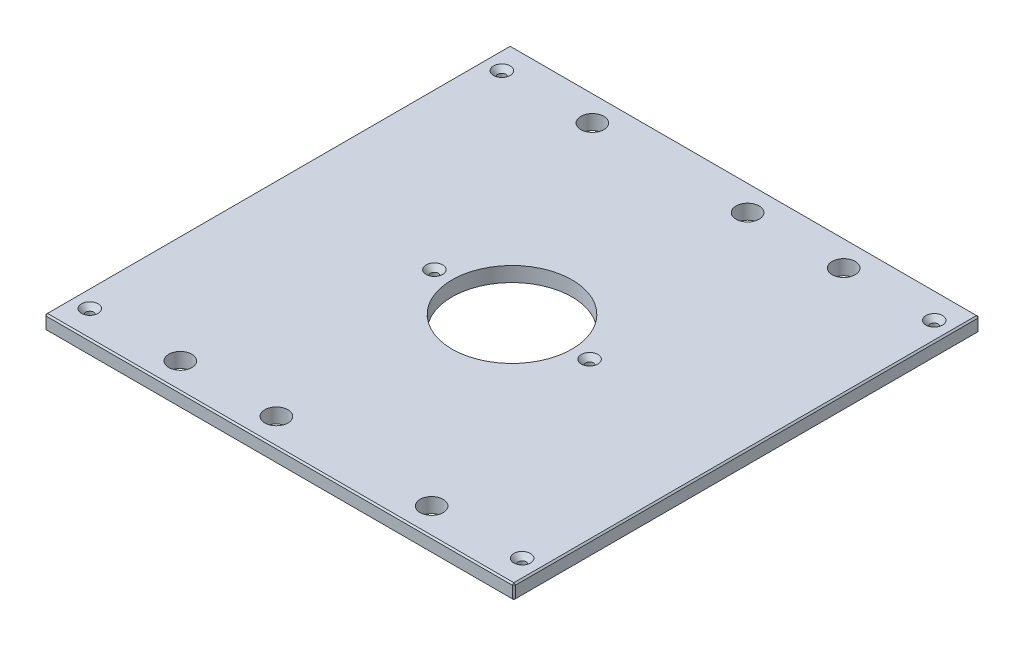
ISO-10303-21;
HEADER;
FILE_DESCRIPTION(('STEP AP214'),'2;1');
FILE_NAME('part.step','',(''),(''),'','','');
FILE_SCHEMA(('AUTOMOTIVE_DESIGN { 1 0 10303 214 1 1 1 1 }'));
ENDSEC;
DATA;
#1=APPLICATION_CONTEXT('core data for automotive mechanical design processes');
#2=APPLICATION_PROTOCOL_DEFINITION('international standard','automotive_design',2000,#1);
#3=PRODUCT_CONTEXT('',#1,'mechanical');
#4=PRODUCT('Part','Part','',(#3));
#5=PRODUCT_RELATED_PRODUCT_CATEGORY('part','',(#4));
#6=PRODUCT_DEFINITION_FORMATION('','',#4);
#7=PRODUCT_DEFINITION_CONTEXT('part definition',#1,'design');
#8=PRODUCT_DEFINITION('design','',#6,#7);
#9=PRODUCT_DEFINITION_SHAPE('','',#8);
#10=(LENGTH_UNIT() NAMED_UNIT(*) SI_UNIT(.MILLI.,.METRE.));
#11=(NAMED_UNIT(*) PLANE_ANGLE_UNIT() SI_UNIT($,.RADIAN.));
#12=(NAMED_UNIT(*) SI_UNIT($,.STERADIAN.) SOLID_ANGLE_UNIT());
#13=UNCERTAINTY_MEASURE_WITH_UNIT(LENGTH_MEASURE(1.E-05),#10,'distance_accuracy_value','');
#14=(GEOMETRIC_REPRESENTATION_CONTEXT(3) GLOBAL_UNCERTAINTY_ASSIGNED_CONTEXT((#13)) GLOBAL_UNIT_ASSIGNED_CONTEXT((#10,
#11,#12)) REPRESENTATION_CONTEXT('',''));
#15=CARTESIAN_POINT('',(0.,0.,0.));
#16=DIRECTION('',(0.,0.,1.));
#17=DIRECTION('',(1.,0.,0.));
#18=AXIS2_PLACEMENT_3D('',#15,#16,#17);
#19=CARTESIAN_POINT('',(-201.6125,12.7,-200.025));
#20=DIRECTION('',(1.,0.,0.));
#21=DIRECTION('',(0.,0.,-1.));
#22=AXIS2_PLACEMENT_3D('',#19,#20,#21);
#23=PLANE('',#22);
#24=DIRECTION('',(0.,0.,-1.));
#25=VECTOR('',#24,1.);
#26=CARTESIAN_POINT('',(-201.6125,11.4300000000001,-200.025));
#27=LINE('',#26,#25);
#28=CARTESIAN_POINT('',(-201.6125,11.4300000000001,198.755));
#29=VERTEX_POINT('',#28);
#30=CARTESIAN_POINT('',(-201.6125,11.4300000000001,-198.755));
#31=VERTEX_POINT('',#30);
#32=EDGE_CURVE('E135',#29,#31,#27,.T.);
#33=ORIENTED_EDGE('',*,*,#32,.T.);
#34=DIRECTION('',(0.,-1.,0.));
#35=VECTOR('',#34,1.);
#36=CARTESIAN_POINT('',(-201.6125,12.7,-198.755));
#37=LINE('',#36,#35);
#38=CARTESIAN_POINT('',(-201.6125,1.26999999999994,-198.755));
#39=VERTEX_POINT('',#38);
#40=EDGE_CURVE('E131',#31,#39,#37,.T.);
#41=ORIENTED_EDGE('',*,*,#40,.T.);
#42=DIRECTION('',(0.,0.,1.));
#43=VECTOR('',#42,1.);
#44=CARTESIAN_POINT('',(-201.6125,1.26999999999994,-200.025));
#45=LINE('',#44,#43);
#46=CARTESIAN_POINT('',(-201.6125,1.26999999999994,198.755));
#47=VERTEX_POINT('',#46);
#48=EDGE_CURVE('E126',#39,#47,#45,.T.);
#49=ORIENTED_EDGE('',*,*,#48,.T.);
#50=DIRECTION('',(0.,1.,0.));
#51=VECTOR('',#50,1.);
#52=CARTESIAN_POINT('',(-201.6125,12.7,198.755));
#53=LINE('',#52,#51);
#54=EDGE_CURVE('E128',#47,#29,#53,.T.);
#55=ORIENTED_EDGE('',*,*,#54,.T.);
#56=EDGE_LOOP('',(#33,#41,#49,#55));
#57=FACE_BOUND('',#56,.T.);
#58=ADVANCED_FACE('F35',(#57),#23,.F.);
#59=CARTESIAN_POINT('',(-201.6125,12.7,200.025));
#60=DIRECTION('',(0.,0.,-1.));
#61=DIRECTION('',(-1.,0.,0.));
#62=AXIS2_PLACEMENT_3D('',#59,#60,#61);
#63=PLANE('',#62);
#64=DIRECTION('',(1.,0.,0.));
#65=VECTOR('',#64,1.);
#66=CARTESIAN_POINT('',(-201.6125,1.26999999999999,200.025));
#67=LINE('',#66,#65);
#68=CARTESIAN_POINT('',(-200.3425,1.26999999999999,200.025));
#69=VERTEX_POINT('',#68);
#70=CARTESIAN_POINT('',(200.3425,1.26999999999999,200.025));
#71=VERTEX_POINT('',#70);
#72=EDGE_CURVE('E58',#69,#71,#67,.T.);
#73=ORIENTED_EDGE('',*,*,#72,.T.);
#74=DIRECTION('',(0.,1.,0.));
#75=VECTOR('',#74,1.);
#76=CARTESIAN_POINT('',(200.3425,12.7,200.025));
#77=LINE('',#76,#75);
#78=CARTESIAN_POINT('',(200.3425,11.43,200.025));
#79=VERTEX_POINT('',#78);
#80=EDGE_CURVE('E11',#71,#79,#77,.T.);
#81=ORIENTED_EDGE('',*,*,#80,.T.);
#82=DIRECTION('',(-1.,0.,0.));
#83=VECTOR('',#82,1.);
#84=CARTESIAN_POINT('',(-201.6125,11.43,200.025));
#85=LINE('',#84,#83);
#86=CARTESIAN_POINT('',(-200.3425,11.43,200.025));
#87=VERTEX_POINT('',#86);
#88=EDGE_CURVE('E44',#79,#87,#85,.T.);
#89=ORIENTED_EDGE('',*,*,#88,.T.);
#90=DIRECTION('',(0.,-1.,0.));
#91=VECTOR('',#90,1.);
#92=CARTESIAN_POINT('',(-200.3425,12.7,200.025));
#93=LINE('',#92,#91);
#94=EDGE_CURVE('E291',#87,#69,#93,.T.);
#95=ORIENTED_EDGE('',*,*,#94,.T.);
#96=EDGE_LOOP('',(#73,#81,#89,#95));
#97=FACE_BOUND('',#96,.T.);
#98=ADVANCED_FACE('F360',(#97),#63,.F.);
#99=CARTESIAN_POINT('',(201.6125,12.7,-200.025));
#100=DIRECTION('',(-1.,0.,0.));
#101=DIRECTION('',(0.,0.,1.));
#102=AXIS2_PLACEMENT_3D('',#99,#100,#101);
#103=PLANE('',#102);
#104=DIRECTION('',(0.,0.,-1.));
#105=VECTOR('',#104,1.);
#106=CARTESIAN_POINT('',(201.6125,1.26999999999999,-200.025));
#107=LINE('',#106,#105);
#108=CARTESIAN_POINT('',(201.6125,1.26999999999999,198.755));
#109=VERTEX_POINT('',#108);
#110=CARTESIAN_POINT('',(201.6125,1.26999999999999,-198.755));
#111=VERTEX_POINT('',#110);
#112=EDGE_CURVE('E286',#109,#111,#107,.T.);
#113=ORIENTED_EDGE('',*,*,#112,.T.);
#114=DIRECTION('',(0.,1.,0.));
#115=VECTOR('',#114,1.);
#116=CARTESIAN_POINT('',(201.6125,12.7,-198.755));
#117=LINE('',#116,#115);
#118=CARTESIAN_POINT('',(201.6125,11.4300000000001,-198.755));
#119=VERTEX_POINT('',#118);
#120=EDGE_CURVE('E288',#111,#119,#117,.T.);
#121=ORIENTED_EDGE('',*,*,#120,.T.);
#122=DIRECTION('',(0.,0.,1.));
#123=VECTOR('',#122,1.);
#124=CARTESIAN_POINT('',(201.6125,11.4300000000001,200.025));
#125=LINE('',#124,#123);
#126=CARTESIAN_POINT('',(201.6125,11.4300000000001,198.755));
#127=VERTEX_POINT('',#126);
#128=EDGE_CURVE('E284',#119,#127,#125,.T.);
#129=ORIENTED_EDGE('',*,*,#128,.T.);
#130=DIRECTION('',(0.,-1.,0.));
#131=VECTOR('',#130,1.);
#132=CARTESIAN_POINT('',(201.6125,12.7,198.755));
#133=LINE('',#132,#131);
#134=EDGE_CURVE('E282',#127,#109,#133,.T.);
#135=ORIENTED_EDGE('',*,*,#134,.T.);
#136=EDGE_LOOP('',(#113,#121,#129,#135));
#137=FACE_BOUND('',#136,.T.);
#138=ADVANCED_FACE('F347',(#137),#103,.F.);
#139=CARTESIAN_POINT('',(-201.6125,12.7,-200.025));
#140=DIRECTION('',(0.,0.,1.));
#141=DIRECTION('',(1.,0.,0.));
#142=AXIS2_PLACEMENT_3D('',#139,#140,#141);
#143=PLANE('',#142);
#144=DIRECTION('',(-1.,0.,0.));
#145=VECTOR('',#144,1.);
#146=CARTESIAN_POINT('',(-201.6125,1.26999999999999,-200.025));
#147=LINE('',#146,#145);
#148=CARTESIAN_POINT('',(200.3425,1.26999999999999,-200.025));
#149=VERTEX_POINT('',#148);
#150=CARTESIAN_POINT('',(-200.3425,1.26999999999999,-200.025));
#151=VERTEX_POINT('',#150);
#152=EDGE_CURVE('E258',#149,#151,#147,.T.);
#153=ORIENTED_EDGE('',*,*,#152,.T.);
#154=DIRECTION('',(0.,1.,0.));
#155=VECTOR('',#154,1.);
#156=CARTESIAN_POINT('',(-200.3425,12.7,-200.025));
#157=LINE('',#156,#155);
#158=CARTESIAN_POINT('',(-200.3425,11.4300000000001,-200.025));
#159=VERTEX_POINT('',#158);
#160=EDGE_CURVE('E262',#151,#159,#157,.T.);
#161=ORIENTED_EDGE('',*,*,#160,.T.);
#162=DIRECTION('',(1.,0.,0.));
#163=VECTOR('',#162,1.);
#164=CARTESIAN_POINT('',(201.6125,11.4300000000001,-200.025));
#165=LINE('',#164,#163);
#166=CARTESIAN_POINT('',(200.3425,11.4300000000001,-200.025));
#167=VERTEX_POINT('',#166);
#168=EDGE_CURVE('E260',#159,#167,#165,.T.);
#169=ORIENTED_EDGE('',*,*,#168,.T.);
#170=DIRECTION('',(0.,-1.,0.));
#171=VECTOR('',#170,1.);
#172=CARTESIAN_POINT('',(200.3425,12.7,-200.025));
#173=LINE('',#172,#171);
#174=EDGE_CURVE('E256',#167,#149,#173,.T.);
#175=ORIENTED_EDGE('',*,*,#174,.T.);
#176=EDGE_LOOP('',(#153,#161,#169,#175));
#177=FACE_BOUND('',#176,.T.);
#178=ADVANCED_FACE('F321',(#177),#143,.F.);
#179=CARTESIAN_POINT('',(0.,12.7,0.));
#180=DIRECTION('',(0.,1.,0.));
#181=DIRECTION('',(0.,0.,1.));
#182=AXIS2_PLACEMENT_3D('',#179,#180,#181);
#183=PLANE('',#182);
#184=CARTESIAN_POINT('',(185.7375,12.7,-177.00498));
#185=DIRECTION('',(0.,1.,0.));
#186=DIRECTION('',(0.,0.,1.));
#187=AXIS2_PLACEMENT_3D('',#184,#185,#186);
#188=CIRCLE('',#187,7.13739999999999);
#189=CARTESIAN_POINT('',(185.7375,12.7,-169.86758));
#190=VERTEX_POINT('',#189);
#191=EDGE_CURVE('E784',#190,#190,#188,.T.);
#192=ORIENTED_EDGE('',*,*,#191,.F.);
#193=EDGE_LOOP('',(#192));
#194=FACE_BOUND('',#193,.T.);
#195=CARTESIAN_POINT('',(185.7375,12.7,177.00498));
#196=DIRECTION('',(0.,1.,0.));
#197=DIRECTION('',(0.,0.,1.));
#198=AXIS2_PLACEMENT_3D('',#195,#196,#197);
#199=CIRCLE('',#198,7.13739999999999);
#200=CARTESIAN_POINT('',(185.7375,12.7,184.14238));
#201=VERTEX_POINT('',#200);
#202=EDGE_CURVE('E788',#201,#201,#199,.T.);
#203=ORIENTED_EDGE('',*,*,#202,.F.);
#204=EDGE_LOOP('',(#203));
#205=FACE_BOUND('',#204,.T.);
#206=CARTESIAN_POINT('',(-185.7375,12.7,177.00498));
#207=DIRECTION('',(0.,1.,0.));
#208=DIRECTION('',(0.,0.,1.));
#209=AXIS2_PLACEMENT_3D('',#206,#207,#208);
#210=CIRCLE('',#209,7.13739999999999);
#211=CARTESIAN_POINT('',(-185.7375,12.7,184.14238));
#212=VERTEX_POINT('',#211);
#213=EDGE_CURVE('E792',#212,#212,#210,.T.);
#214=ORIENTED_EDGE('',*,*,#213,.F.);
#215=EDGE_LOOP('',(#214));
#216=FACE_BOUND('',#215,.T.);
#217=CARTESIAN_POINT('',(-66.675,12.7,0.));
#218=DIRECTION('',(0.,1.,0.));
#219=DIRECTION('',(0.,0.,1.));
#220=AXIS2_PLACEMENT_3D('',#217,#218,#219);
#221=CIRCLE('',#220,7.1374);
#222=CARTESIAN_POINT('',(-66.675,12.7,7.1374));
#223=VERTEX_POINT('',#222);
#224=EDGE_CURVE('E796',#223,#223,#221,.T.);
#225=ORIENTED_EDGE('',*,*,#224,.F.);
#226=EDGE_LOOP('',(#225));
#227=FACE_BOUND('',#226,.T.);
#228=CARTESIAN_POINT('',(66.675,12.7,0.));
#229=DIRECTION('',(0.,1.,0.));
#230=DIRECTION('',(0.,0.,1.));
#231=AXIS2_PLACEMENT_3D('',#228,#229,#230);
#232=CIRCLE('',#231,7.1374);
#233=CARTESIAN_POINT('',(66.675,12.7,7.1374));
#234=VERTEX_POINT('',#233);
#235=EDGE_CURVE('E800',#234,#234,#232,.T.);
#236=ORIENTED_EDGE('',*,*,#235,.F.);
#237=EDGE_LOOP('',(#236));
#238=FACE_BOUND('',#237,.T.);
#239=CARTESIAN_POINT('',(-185.7375,12.7,-177.00498));
#240=DIRECTION('',(0.,1.,0.));
#241=DIRECTION('',(0.,0.,1.));
#242=AXIS2_PLACEMENT_3D('',#239,#240,#241);
#243=CIRCLE('',#242,7.13739999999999);
#244=CARTESIAN_POINT('',(-185.7375,12.7,-169.86758));
#245=VERTEX_POINT('',#244);
#246=EDGE_CURVE('E803',#245,#245,#243,.T.);
#247=ORIENTED_EDGE('',*,*,#246,.F.);
#248=EDGE_LOOP('',(#247));
#249=FACE_BOUND('',#248,.T.);
#250=DIRECTION('',(0.,0.,-1.));
#251=VECTOR('',#250,1.);
#252=CARTESIAN_POINT('',(200.3425,12.7,-200.025));
#253=LINE('',#252,#251);
#254=CARTESIAN_POINT('',(200.3425,12.7,198.755));
#255=VERTEX_POINT('',#254);
#256=CARTESIAN_POINT('',(200.3425,12.7,-198.755));
#257=VERTEX_POINT('',#256);
#258=EDGE_CURVE('E269',#255,#257,#253,.T.);
#259=ORIENTED_EDGE('',*,*,#258,.T.);
#260=DIRECTION('',(-1.,0.,0.));
#261=VECTOR('',#260,1.);
#262=CARTESIAN_POINT('',(-201.6125,12.7,-198.755));
#263=LINE('',#262,#261);
#264=CARTESIAN_POINT('',(-200.3425,12.7,-198.755));
#265=VERTEX_POINT('',#264);
#266=EDGE_CURVE('E271',#257,#265,#263,.T.);
#267=ORIENTED_EDGE('',*,*,#266,.T.);
#268=DIRECTION('',(0.,0.,1.));
#269=VECTOR('',#268,1.);
#270=CARTESIAN_POINT('',(-200.3425,12.7,200.025));
#271=LINE('',#270,#269);
#272=CARTESIAN_POINT('',(-200.3425,12.7,198.755));
#273=VERTEX_POINT('',#272);
#274=EDGE_CURVE('E267',#265,#273,#271,.T.);
#275=ORIENTED_EDGE('',*,*,#274,.T.);
#276=DIRECTION('',(1.,0.,0.));
#277=VECTOR('',#276,1.);
#278=CARTESIAN_POINT('',(201.6125,12.7,198.755));
#279=LINE('',#278,#277);
#280=EDGE_CURVE('E265',#273,#255,#279,.T.);
#281=ORIENTED_EDGE('',*,*,#280,.T.);
#282=EDGE_LOOP('',(#259,#267,#275,#281));
#283=FACE_BOUND('',#282,.T.);
#284=CARTESIAN_POINT('',(107.95,12.7,-177.00498));
#285=DIRECTION('',(0.,1.,0.));
#286=DIRECTION('',(0.,0.,1.));
#287=AXIS2_PLACEMENT_3D('',#284,#285,#286);
#288=CIRCLE('',#287,9.921875);
#289=CARTESIAN_POINT('',(107.95,12.7,-167.083105));
#290=VERTEX_POINT('',#289);
#291=EDGE_CURVE('E204',#290,#290,#288,.T.);
#292=ORIENTED_EDGE('',*,*,#291,.F.);
#293=EDGE_LOOP('',(#292));
#294=FACE_BOUND('',#293,.T.);
#295=CARTESIAN_POINT('',(-107.95,12.7,-177.00498));
#296=DIRECTION('',(0.,1.,0.));
#297=DIRECTION('',(0.,0.,1.));
#298=AXIS2_PLACEMENT_3D('',#295,#296,#297);
#299=CIRCLE('',#298,9.921875);
#300=CARTESIAN_POINT('',(-107.95,12.7,-167.083105));
#301=VERTEX_POINT('',#300);
#302=EDGE_CURVE('E214',#301,#301,#299,.T.);
#303=ORIENTED_EDGE('',*,*,#302,.F.);
#304=EDGE_LOOP('',(#303));
#305=FACE_BOUND('',#304,.T.);
#306=CARTESIAN_POINT('',(107.95,12.7,177.00498));
#307=DIRECTION('',(0.,1.,0.));
#308=DIRECTION('',(0.,0.,1.));
#309=AXIS2_PLACEMENT_3D('',#306,#307,#308);
#310=CIRCLE('',#309,9.921875);
#311=CARTESIAN_POINT('',(107.95,12.7,186.926855));
#312=VERTEX_POINT('',#311);
#313=EDGE_CURVE('E225',#312,#312,#310,.T.);
#314=ORIENTED_EDGE('',*,*,#313,.F.);
#315=EDGE_LOOP('',(#314));
#316=FACE_BOUND('',#315,.T.);
#317=CARTESIAN_POINT('',(-107.95,12.7,177.00498));
#318=DIRECTION('',(0.,1.,0.));
#319=DIRECTION('',(0.,0.,1.));
#320=AXIS2_PLACEMENT_3D('',#317,#318,#319);
#321=CIRCLE('',#320,9.921875);
#322=CARTESIAN_POINT('',(-107.95,12.7,186.926855));
#323=VERTEX_POINT('',#322);
#324=EDGE_CURVE('E231',#323,#323,#321,.T.);
#325=ORIENTED_EDGE('',*,*,#324,.F.);
#326=EDGE_LOOP('',(#325));
#327=FACE_BOUND('',#326,.T.);
#328=CARTESIAN_POINT('',(25.4,12.7,-177.00498));
#329=DIRECTION('',(0.,1.,0.));
#330=DIRECTION('',(0.,0.,1.));
#331=AXIS2_PLACEMENT_3D('',#328,#329,#330);
#332=CIRCLE('',#331,9.921875);
#333=CARTESIAN_POINT('',(25.4,12.7,-167.083105));
#334=VERTEX_POINT('',#333);
#335=EDGE_CURVE('E237',#334,#334,#332,.T.);
#336=ORIENTED_EDGE('',*,*,#335,.F.);
#337=EDGE_LOOP('',(#336));
#338=FACE_BOUND('',#337,.T.);
#339=CARTESIAN_POINT('',(-25.4,12.7,177.00498));
#340=DIRECTION('',(0.,1.,0.));
#341=DIRECTION('',(0.,0.,1.));
#342=AXIS2_PLACEMENT_3D('',#339,#340,#341);
#343=CIRCLE('',#342,9.921875);
#344=CARTESIAN_POINT('',(-25.4,12.7,186.926855));
#345=VERTEX_POINT('',#344);
#346=EDGE_CURVE('E243',#345,#345,#343,.T.);
#347=ORIENTED_EDGE('',*,*,#346,.F.);
#348=EDGE_LOOP('',(#347));
#349=FACE_BOUND('',#348,.T.);
#350=CARTESIAN_POINT('',(0.,12.7,0.));
#351=DIRECTION('',(0.,1.,0.));
#352=DIRECTION('',(0.,0.,1.));
#353=AXIS2_PLACEMENT_3D('',#350,#351,#352);
#354=CIRCLE('',#353,51.562);
#355=CARTESIAN_POINT('',(0.,12.7,51.562));
#356=VERTEX_POINT('',#355);
#357=EDGE_CURVE('E249',#356,#356,#354,.T.);
#358=ORIENTED_EDGE('',*,*,#357,.F.);
#359=EDGE_LOOP('',(#358));
#360=FACE_BOUND('',#359,.T.);
#361=ADVANCED_FACE('F369',(#194,#205,#216,#227,#238,#249,#283,#294,#305,#316,#327,#338,#349,
#360),#183,.T.);
#362=CARTESIAN_POINT('',(0.,0.,0.));
#363=DIRECTION('',(0.,1.,0.));
#364=DIRECTION('',(0.,0.,1.));
#365=AXIS2_PLACEMENT_3D('',#362,#363,#364);
#366=PLANE('',#365);
#367=CARTESIAN_POINT('',(185.7375,0.,-177.00498));
#368=DIRECTION('',(0.,1.,0.));
#369=DIRECTION('',(0.,0.,1.));
#370=AXIS2_PLACEMENT_3D('',#367,#368,#369);
#371=CIRCLE('',#370,3.3782);
#372=CARTESIAN_POINT('',(185.7375,0.,-173.62678));
#373=VERTEX_POINT('',#372);
#374=EDGE_CURVE('E837',#373,#373,#371,.T.);
#375=ORIENTED_EDGE('',*,*,#374,.T.);
#376=EDGE_LOOP('',(#375));
#377=FACE_BOUND('',#376,.T.);
#378=CARTESIAN_POINT('',(185.7375,0.,177.00498));
#379=DIRECTION('',(0.,1.,0.));
#380=DIRECTION('',(0.,0.,1.));
#381=AXIS2_PLACEMENT_3D('',#378,#379,#380);
#382=CIRCLE('',#381,3.3782);
#383=CARTESIAN_POINT('',(185.7375,0.,180.38318));
#384=VERTEX_POINT('',#383);
#385=EDGE_CURVE('E830',#384,#384,#382,.T.);
#386=ORIENTED_EDGE('',*,*,#385,.T.);
#387=EDGE_LOOP('',(#386));
#388=FACE_BOUND('',#387,.T.);
#389=CARTESIAN_POINT('',(-185.7375,0.,177.00498));
#390=DIRECTION('',(0.,1.,0.));
#391=DIRECTION('',(0.,0.,1.));
#392=AXIS2_PLACEMENT_3D('',#389,#390,#391);
#393=CIRCLE('',#392,3.3782);
#394=CARTESIAN_POINT('',(-185.7375,0.,180.38318));
#395=VERTEX_POINT('',#394);
#396=EDGE_CURVE('E823',#395,#395,#393,.T.);
#397=ORIENTED_EDGE('',*,*,#396,.T.);
#398=EDGE_LOOP('',(#397));
#399=FACE_BOUND('',#398,.T.);
#400=CARTESIAN_POINT('',(-66.675,0.,0.));
#401=DIRECTION('',(0.,1.,0.));
#402=DIRECTION('',(0.,0.,1.));
#403=AXIS2_PLACEMENT_3D('',#400,#401,#402);
#404=CIRCLE('',#403,3.3782);
#405=CARTESIAN_POINT('',(-66.675,0.,3.3782));
#406=VERTEX_POINT('',#405);
#407=EDGE_CURVE('E816',#406,#406,#404,.T.);
#408=ORIENTED_EDGE('',*,*,#407,.T.);
#409=EDGE_LOOP('',(#408));
#410=FACE_BOUND('',#409,.T.);
#411=CARTESIAN_POINT('',(66.675,0.,0.));
#412=DIRECTION('',(0.,1.,0.));
#413=DIRECTION('',(0.,0.,1.));
#414=AXIS2_PLACEMENT_3D('',#411,#412,#413);
#415=CIRCLE('',#414,3.3782);
#416=CARTESIAN_POINT('',(66.675,0.,3.3782));
#417=VERTEX_POINT('',#416);
#418=EDGE_CURVE('E806',#417,#417,#415,.T.);
#419=ORIENTED_EDGE('',*,*,#418,.T.);
#420=EDGE_LOOP('',(#419));
#421=FACE_BOUND('',#420,.T.);
#422=CARTESIAN_POINT('',(-185.7375,0.,-177.00498));
#423=DIRECTION('',(0.,1.,0.));
#424=DIRECTION('',(0.,0.,1.));
#425=AXIS2_PLACEMENT_3D('',#422,#423,#424);
#426=CIRCLE('',#425,3.3782);
#427=CARTESIAN_POINT('',(-185.7375,0.,-173.62678));
#428=VERTEX_POINT('',#427);
#429=EDGE_CURVE('E217',#428,#428,#426,.T.);
#430=ORIENTED_EDGE('',*,*,#429,.T.);
#431=EDGE_LOOP('',(#430));
#432=FACE_BOUND('',#431,.T.);
#433=DIRECTION('',(0.,0.,-1.));
#434=VECTOR('',#433,1.);
#435=CARTESIAN_POINT('',(-200.3425,0.,0.));
#436=LINE('',#435,#434);
#437=CARTESIAN_POINT('',(-200.3425,0.,198.755));
#438=VERTEX_POINT('',#437);
#439=CARTESIAN_POINT('',(-200.3425,0.,-198.755));
#440=VERTEX_POINT('',#439);
#441=EDGE_CURVE('E158',#438,#440,#436,.T.);
#442=ORIENTED_EDGE('',*,*,#441,.T.);
#443=DIRECTION('',(1.,0.,0.));
#444=VECTOR('',#443,1.);
#445=CARTESIAN_POINT('',(0.,0.,-198.755));
#446=LINE('',#445,#444);
#447=CARTESIAN_POINT('',(200.3425,0.,-198.755));
#448=VERTEX_POINT('',#447);
#449=EDGE_CURVE('E279',#440,#448,#446,.T.);
#450=ORIENTED_EDGE('',*,*,#449,.T.);
#451=DIRECTION('',(0.,0.,1.));
#452=VECTOR('',#451,1.);
#453=CARTESIAN_POINT('',(200.3425,0.,0.));
#454=LINE('',#453,#452);
#455=CARTESIAN_POINT('',(200.3425,0.,198.755));
#456=VERTEX_POINT('',#455);
#457=EDGE_CURVE('E277',#448,#456,#454,.T.);
#458=ORIENTED_EDGE('',*,*,#457,.T.);
#459=DIRECTION('',(-1.,0.,0.));
#460=VECTOR('',#459,1.);
#461=CARTESIAN_POINT('',(0.,0.,198.755));
#462=LINE('',#461,#460);
#463=EDGE_CURVE('E274',#456,#438,#462,.T.);
#464=ORIENTED_EDGE('',*,*,#463,.T.);
#465=EDGE_LOOP('',(#442,#450,#458,#464));
#466=FACE_BOUND('',#465,.T.);
#467=CARTESIAN_POINT('',(107.95,0.,-177.00498));
#468=DIRECTION('',(0.,1.,0.));
#469=DIRECTION('',(0.,0.,1.));
#470=AXIS2_PLACEMENT_3D('',#467,#468,#469);
#471=CIRCLE('',#470,9.921875);
#472=CARTESIAN_POINT('',(107.95,0.,-167.083105));
#473=VERTEX_POINT('',#472);
#474=EDGE_CURVE('E209',#473,#473,#471,.T.);
#475=ORIENTED_EDGE('',*,*,#474,.T.);
#476=EDGE_LOOP('',(#475));
#477=FACE_BOUND('',#476,.T.);
#478=CARTESIAN_POINT('',(-107.95,0.,-177.00498));
#479=DIRECTION('',(0.,1.,0.));
#480=DIRECTION('',(0.,0.,1.));
#481=AXIS2_PLACEMENT_3D('',#478,#479,#480);
#482=CIRCLE('',#481,9.921875);
#483=CARTESIAN_POINT('',(-107.95,0.,-167.083105));
#484=VERTEX_POINT('',#483);
#485=EDGE_CURVE('E222',#484,#484,#482,.T.);
#486=ORIENTED_EDGE('',*,*,#485,.T.);
#487=EDGE_LOOP('',(#486));
#488=FACE_BOUND('',#487,.T.);
#489=CARTESIAN_POINT('',(107.95,0.,177.00498));
#490=DIRECTION('',(0.,1.,0.));
#491=DIRECTION('',(0.,0.,1.));
#492=AXIS2_PLACEMENT_3D('',#489,#490,#491);
#493=CIRCLE('',#492,9.921875);
#494=CARTESIAN_POINT('',(107.95,0.,186.926855));
#495=VERTEX_POINT('',#494);
#496=EDGE_CURVE('E228',#495,#495,#493,.T.);
#497=ORIENTED_EDGE('',*,*,#496,.T.);
#498=EDGE_LOOP('',(#497));
#499=FACE_BOUND('',#498,.T.);
#500=CARTESIAN_POINT('',(-107.95,0.,177.00498));
#501=DIRECTION('',(0.,1.,0.));
#502=DIRECTION('',(0.,0.,1.));
#503=AXIS2_PLACEMENT_3D('',#500,#501,#502);
#504=CIRCLE('',#503,9.921875);
#505=CARTESIAN_POINT('',(-107.95,0.,186.926855));
#506=VERTEX_POINT('',#505);
#507=EDGE_CURVE('E234',#506,#506,#504,.T.);
#508=ORIENTED_EDGE('',*,*,#507,.T.);
#509=EDGE_LOOP('',(#508));
#510=FACE_BOUND('',#509,.T.);
#511=CARTESIAN_POINT('',(25.4,0.,-177.00498));
#512=DIRECTION('',(0.,1.,0.));
#513=DIRECTION('',(0.,0.,1.));
#514=AXIS2_PLACEMENT_3D('',#511,#512,#513);
#515=CIRCLE('',#514,9.921875);
#516=CARTESIAN_POINT('',(25.4,0.,-167.083105));
#517=VERTEX_POINT('',#516);
#518=EDGE_CURVE('E240',#517,#517,#515,.T.);
#519=ORIENTED_EDGE('',*,*,#518,.T.);
#520=EDGE_LOOP('',(#519));
#521=FACE_BOUND('',#520,.T.);
#522=CARTESIAN_POINT('',(-25.4,0.,177.00498));
#523=DIRECTION('',(0.,1.,0.));
#524=DIRECTION('',(0.,0.,1.));
#525=AXIS2_PLACEMENT_3D('',#522,#523,#524);
#526=CIRCLE('',#525,9.921875);
#527=CARTESIAN_POINT('',(-25.4,0.,186.926855));
#528=VERTEX_POINT('',#527);
#529=EDGE_CURVE('E246',#528,#528,#526,.T.);
#530=ORIENTED_EDGE('',*,*,#529,.T.);
#531=EDGE_LOOP('',(#530));
#532=FACE_BOUND('',#531,.T.);
#533=CARTESIAN_POINT('',(0.,0.,0.));
#534=DIRECTION('',(0.,1.,0.));
#535=DIRECTION('',(0.,0.,1.));
#536=AXIS2_PLACEMENT_3D('',#533,#534,#535);
#537=CIRCLE('',#536,51.562);
#538=CARTESIAN_POINT('',(0.,0.,51.562));
#539=VERTEX_POINT('',#538);
#540=EDGE_CURVE('E147',#539,#539,#537,.T.);
#541=ORIENTED_EDGE('',*,*,#540,.T.);
#542=EDGE_LOOP('',(#541));
#543=FACE_BOUND('',#542,.T.);
#544=ADVANCED_FACE('F334',(#377,#388,#399,#410,#421,#432,#466,#477,#488,#499,#510,#521,#532,
#543),#366,.F.);
#545=CARTESIAN_POINT('',(0.,0.,0.));
#546=DIRECTION('',(0.,1.,0.));
#547=DIRECTION('',(0.,0.,1.));
#548=AXIS2_PLACEMENT_3D('',#545,#546,#547);
#549=CYLINDRICAL_SURFACE('',#548,51.562);
#550=ORIENTED_EDGE('',*,*,#540,.F.);
#551=EDGE_LOOP('',(#550));
#552=FACE_BOUND('',#551,.T.);
#553=ORIENTED_EDGE('',*,*,#357,.T.);
#554=EDGE_LOOP('',(#553));
#555=FACE_BOUND('',#554,.T.);
#556=ADVANCED_FACE('F721',(#552,#555),#549,.F.);
#557=CARTESIAN_POINT('',(-25.4,12.7,177.00498));
#558=DIRECTION('',(0.,1.,0.));
#559=DIRECTION('',(0.,0.,1.));
#560=AXIS2_PLACEMENT_3D('',#557,#558,#559);
#561=CYLINDRICAL_SURFACE('',#560,9.921875);
#562=ORIENTED_EDGE('',*,*,#529,.F.);
#563=EDGE_LOOP('',(#562));
#564=FACE_BOUND('',#563,.T.);
#565=ORIENTED_EDGE('',*,*,#346,.T.);
#566=EDGE_LOOP('',(#565));
#567=FACE_BOUND('',#566,.T.);
#568=ADVANCED_FACE('F712',(#564,#567),#561,.F.);
#569=CARTESIAN_POINT('',(25.4,12.7,-177.00498));
#570=DIRECTION('',(0.,1.,0.));
#571=DIRECTION('',(0.,0.,1.));
#572=AXIS2_PLACEMENT_3D('',#569,#570,#571);
#573=CYLINDRICAL_SURFACE('',#572,9.921875);
#574=ORIENTED_EDGE('',*,*,#518,.F.);
#575=EDGE_LOOP('',(#574));
#576=FACE_BOUND('',#575,.T.);
#577=ORIENTED_EDGE('',*,*,#335,.T.);
#578=EDGE_LOOP('',(#577));
#579=FACE_BOUND('',#578,.T.);
#580=ADVANCED_FACE('F703',(#576,#579),#573,.F.);
#581=CARTESIAN_POINT('',(-107.95,12.7,177.00498));
#582=DIRECTION('',(0.,1.,0.));
#583=DIRECTION('',(0.,0.,1.));
#584=AXIS2_PLACEMENT_3D('',#581,#582,#583);
#585=CYLINDRICAL_SURFACE('',#584,9.921875);
#586=ORIENTED_EDGE('',*,*,#507,.F.);
#587=EDGE_LOOP('',(#586));
#588=FACE_BOUND('',#587,.T.);
#589=ORIENTED_EDGE('',*,*,#324,.T.);
#590=EDGE_LOOP('',(#589));
#591=FACE_BOUND('',#590,.T.);
#592=ADVANCED_FACE('F694',(#588,#591),#585,.F.);
#593=CARTESIAN_POINT('',(107.95,12.7,177.00498));
#594=DIRECTION('',(0.,1.,0.));
#595=DIRECTION('',(0.,0.,1.));
#596=AXIS2_PLACEMENT_3D('',#593,#594,#595);
#597=CYLINDRICAL_SURFACE('',#596,9.921875);
#598=ORIENTED_EDGE('',*,*,#496,.F.);
#599=EDGE_LOOP('',(#598));
#600=FACE_BOUND('',#599,.T.);
#601=ORIENTED_EDGE('',*,*,#313,.T.);
#602=EDGE_LOOP('',(#601));
#603=FACE_BOUND('',#602,.T.);
#604=ADVANCED_FACE('F685',(#600,#603),#597,.F.);
#605=CARTESIAN_POINT('',(-107.95,12.7,-177.00498));
#606=DIRECTION('',(0.,1.,0.));
#607=DIRECTION('',(0.,0.,1.));
#608=AXIS2_PLACEMENT_3D('',#605,#606,#607);
#609=CYLINDRICAL_SURFACE('',#608,9.921875);
#610=ORIENTED_EDGE('',*,*,#485,.F.);
#611=EDGE_LOOP('',(#610));
#612=FACE_BOUND('',#611,.T.);
#613=ORIENTED_EDGE('',*,*,#302,.T.);
#614=EDGE_LOOP('',(#613));
#615=FACE_BOUND('',#614,.T.);
#616=ADVANCED_FACE('F675',(#612,#615),#609,.F.);
#617=CARTESIAN_POINT('',(107.95,12.7,-177.00498));
#618=DIRECTION('',(0.,1.,0.));
#619=DIRECTION('',(0.,0.,1.));
#620=AXIS2_PLACEMENT_3D('',#617,#618,#619);
#621=CYLINDRICAL_SURFACE('',#620,9.921875);
#622=ORIENTED_EDGE('',*,*,#474,.F.);
#623=EDGE_LOOP('',(#622));
#624=FACE_BOUND('',#623,.T.);
#625=ORIENTED_EDGE('',*,*,#291,.T.);
#626=EDGE_LOOP('',(#625));
#627=FACE_BOUND('',#626,.T.);
#628=ADVANCED_FACE('F378',(#624,#627),#621,.F.);
#629=CARTESIAN_POINT('',(201.6125,12.7,198.755));
#630=DIRECTION('',(-0.707106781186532,0.,-0.707106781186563));
#631=DIRECTION('',(0.,-1.,0.));
#632=AXIS2_PLACEMENT_3D('',#629,#630,#631);
#633=PLANE('',#632);
#634=DIRECTION('',(-0.707106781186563,0.,0.707106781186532));
#635=VECTOR('',#634,1.);
#636=CARTESIAN_POINT('',(201.6125,11.4300000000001,198.755));
#637=LINE('',#636,#635);
#638=EDGE_CURVE('E39',#79,#127,#637,.F.);
#639=ORIENTED_EDGE('',*,*,#638,.F.);
#640=ORIENTED_EDGE('',*,*,#80,.F.);
#641=DIRECTION('',(0.707106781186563,0.,-0.707106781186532));
#642=VECTOR('',#641,1.);
#643=CARTESIAN_POINT('',(200.9775,1.26999999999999,199.39));
#644=LINE('',#643,#642);
#645=EDGE_CURVE('E197',#109,#71,#644,.F.);
#646=ORIENTED_EDGE('',*,*,#645,.F.);
#647=ORIENTED_EDGE('',*,*,#134,.F.);
#648=EDGE_LOOP('',(#639,#640,#646,#647));
#649=FACE_BOUND('',#648,.T.);
#650=ADVANCED_FACE('F37',(#649),#633,.F.);
#651=CARTESIAN_POINT('',(201.6125,11.4300000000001,198.755));
#652=DIRECTION('',(0.577350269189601,0.577350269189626,0.577350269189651));
#653=DIRECTION('',(0.,-0.707106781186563,0.707106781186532));
#654=AXIS2_PLACEMENT_3D('',#651,#652,#653);
#655=PLANE('',#654);
#656=DIRECTION('',(0.,-0.707106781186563,0.707106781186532));
#657=VECTOR('',#656,1.);
#658=CARTESIAN_POINT('',(200.3425,12.065,199.39));
#659=LINE('',#658,#657);
#660=EDGE_CURVE('E193',#79,#255,#659,.F.);
#661=ORIENTED_EDGE('',*,*,#660,.F.);
#662=ORIENTED_EDGE('',*,*,#638,.T.);
#663=DIRECTION('',(-0.707106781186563,0.707106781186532,0.));
#664=VECTOR('',#663,1.);
#665=CARTESIAN_POINT('',(201.6125,11.4300000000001,198.755));
#666=LINE('',#665,#664);
#667=EDGE_CURVE('E195',#255,#127,#666,.F.);
#668=ORIENTED_EDGE('',*,*,#667,.F.);
#669=EDGE_LOOP('',(#661,#662,#668));
#670=FACE_BOUND('',#669,.T.);
#671=ADVANCED_FACE('F371',(#670),#655,.T.);
#672=CARTESIAN_POINT('',(200.3425,0.,198.755));
#673=DIRECTION('',(0.577350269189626,-0.577350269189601,0.577350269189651));
#674=DIRECTION('',(0.707106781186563,0.,-0.707106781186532));
#675=AXIS2_PLACEMENT_3D('',#672,#673,#674);
#676=PLANE('',#675);
#677=DIRECTION('',(-0.707106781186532,-0.707106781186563,0.));
#678=VECTOR('',#677,1.);
#679=CARTESIAN_POINT('',(200.3425,0.,198.755));
#680=LINE('',#679,#678);
#681=EDGE_CURVE('E187',#109,#456,#680,.T.);
#682=ORIENTED_EDGE('',*,*,#681,.F.);
#683=ORIENTED_EDGE('',*,*,#645,.T.);
#684=DIRECTION('',(0.,0.707106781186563,0.707106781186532));
#685=VECTOR('',#684,1.);
#686=CARTESIAN_POINT('',(200.3425,0.,198.755));
#687=LINE('',#686,#685);
#688=EDGE_CURVE('E190',#456,#71,#687,.T.);
#689=ORIENTED_EDGE('',*,*,#688,.F.);
#690=EDGE_LOOP('',(#682,#683,#689));
#691=FACE_BOUND('',#690,.T.);
#692=ADVANCED_FACE('F340',(#691),#676,.T.);
#693=CARTESIAN_POINT('',(200.3425,12.7,0.));
#694=DIRECTION('',(0.707106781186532,0.707106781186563,0.));
#695=DIRECTION('',(0.,0.,1.));
#696=AXIS2_PLACEMENT_3D('',#693,#694,#695);
#697=PLANE('',#696);
#698=ORIENTED_EDGE('',*,*,#667,.T.);
#699=ORIENTED_EDGE('',*,*,#128,.F.);
#700=DIRECTION('',(0.707106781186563,-0.707106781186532,0.));
#701=VECTOR('',#700,1.);
#702=CARTESIAN_POINT('',(200.9775,12.065,-198.755));
#703=LINE('',#702,#701);
#704=EDGE_CURVE('E182',#257,#119,#703,.T.);
#705=ORIENTED_EDGE('',*,*,#704,.F.);
#706=ORIENTED_EDGE('',*,*,#258,.F.);
#707=EDGE_LOOP('',(#698,#699,#705,#706));
#708=FACE_BOUND('',#707,.T.);
#709=ADVANCED_FACE('F357',(#708),#697,.T.);
#710=CARTESIAN_POINT('',(0.,12.7,198.755));
#711=DIRECTION('',(0.,0.707106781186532,0.707106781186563));
#712=DIRECTION('',(-1.,0.,0.));
#713=AXIS2_PLACEMENT_3D('',#710,#711,#712);
#714=PLANE('',#713);
#715=ORIENTED_EDGE('',*,*,#660,.T.);
#716=ORIENTED_EDGE('',*,*,#280,.F.);
#717=DIRECTION('',(0.,0.707106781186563,-0.707106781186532));
#718=VECTOR('',#717,1.);
#719=CARTESIAN_POINT('',(-200.3425,12.7,198.755));
#720=LINE('',#719,#718);
#721=EDGE_CURVE('E179',#87,#273,#720,.T.);
#722=ORIENTED_EDGE('',*,*,#721,.F.);
#723=ORIENTED_EDGE('',*,*,#88,.F.);
#724=EDGE_LOOP('',(#715,#716,#722,#723));
#725=FACE_BOUND('',#724,.T.);
#726=ADVANCED_FACE('F362',(#725),#714,.T.);
#727=CARTESIAN_POINT('',(-200.3425,12.7,200.025));
#728=DIRECTION('',(0.707106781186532,0.,-0.707106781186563));
#729=DIRECTION('',(0.,-1.,0.));
#730=AXIS2_PLACEMENT_3D('',#727,#728,#729);
#731=PLANE('',#730);
#732=DIRECTION('',(0.707106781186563,0.,0.707106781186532));
#733=VECTOR('',#732,1.);
#734=CARTESIAN_POINT('',(-201.6125,1.26999999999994,198.755));
#735=LINE('',#734,#733);
#736=EDGE_CURVE('E142',#69,#47,#735,.F.);
#737=ORIENTED_EDGE('',*,*,#736,.F.);
#738=ORIENTED_EDGE('',*,*,#94,.F.);
#739=DIRECTION('',(-0.707106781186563,0.,-0.707106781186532));
#740=VECTOR('',#739,1.);
#741=CARTESIAN_POINT('',(-200.9775,11.43,199.39));
#742=LINE('',#741,#740);
#743=EDGE_CURVE('E145',#29,#87,#742,.F.);
#744=ORIENTED_EDGE('',*,*,#743,.F.);
#745=ORIENTED_EDGE('',*,*,#54,.F.);
#746=EDGE_LOOP('',(#737,#738,#744,#745));
#747=FACE_BOUND('',#746,.T.);
#748=ADVANCED_FACE('F140',(#747),#731,.F.);
#749=CARTESIAN_POINT('',(-201.6125,1.26999999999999,200.025));
#750=DIRECTION('',(0.,0.707106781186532,-0.707106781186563));
#751=DIRECTION('',(1.,0.,0.));
#752=AXIS2_PLACEMENT_3D('',#749,#750,#751);
#753=PLANE('',#752);
#754=ORIENTED_EDGE('',*,*,#688,.T.);
#755=ORIENTED_EDGE('',*,*,#72,.F.);
#756=DIRECTION('',(0.,-0.707106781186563,-0.707106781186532));
#757=VECTOR('',#756,1.);
#758=CARTESIAN_POINT('',(-200.3425,0.634999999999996,199.39));
#759=LINE('',#758,#757);
#760=EDGE_CURVE('E155',#438,#69,#759,.F.);
#761=ORIENTED_EDGE('',*,*,#760,.F.);
#762=ORIENTED_EDGE('',*,*,#463,.F.);
#763=EDGE_LOOP('',(#754,#755,#761,#762));
#764=FACE_BOUND('',#763,.T.);
#765=ADVANCED_FACE('F339',(#764),#753,.F.);
#766=CARTESIAN_POINT('',(201.6125,1.26999999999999,-200.025));
#767=DIRECTION('',(-0.707106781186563,0.707106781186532,0.));
#768=DIRECTION('',(0.,0.,-1.));
#769=AXIS2_PLACEMENT_3D('',#766,#767,#768);
#770=PLANE('',#769);
#771=ORIENTED_EDGE('',*,*,#681,.T.);
#772=ORIENTED_EDGE('',*,*,#457,.F.);
#773=DIRECTION('',(0.707106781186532,0.707106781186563,0.));
#774=VECTOR('',#773,1.);
#775=CARTESIAN_POINT('',(200.3425,0.,-198.755));
#776=LINE('',#775,#774);
#777=EDGE_CURVE('E174',#111,#448,#776,.F.);
#778=ORIENTED_EDGE('',*,*,#777,.F.);
#779=ORIENTED_EDGE('',*,*,#112,.F.);
#780=EDGE_LOOP('',(#771,#772,#778,#779));
#781=FACE_BOUND('',#780,.T.);
#782=ADVANCED_FACE('F344',(#781),#770,.F.);
#783=CARTESIAN_POINT('',(200.3425,12.7,-200.025));
#784=DIRECTION('',(-0.707106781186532,0.,0.707106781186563));
#785=DIRECTION('',(0.,-1.,0.));
#786=AXIS2_PLACEMENT_3D('',#783,#784,#785);
#787=PLANE('',#786);
#788=DIRECTION('',(0.707106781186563,0.,0.707106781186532));
#789=VECTOR('',#788,1.);
#790=CARTESIAN_POINT('',(200.3425,11.4300000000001,-200.025));
#791=LINE('',#790,#789);
#792=EDGE_CURVE('E184',#119,#167,#791,.F.);
#793=ORIENTED_EDGE('',*,*,#792,.F.);
#794=ORIENTED_EDGE('',*,*,#120,.F.);
#795=DIRECTION('',(-0.707106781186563,0.,-0.707106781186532));
#796=VECTOR('',#795,1.);
#797=CARTESIAN_POINT('',(200.9775,1.26999999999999,-199.39));
#798=LINE('',#797,#796);
#799=EDGE_CURVE('E171',#149,#111,#798,.F.);
#800=ORIENTED_EDGE('',*,*,#799,.F.);
#801=ORIENTED_EDGE('',*,*,#174,.F.);
#802=EDGE_LOOP('',(#793,#794,#800,#801));
#803=FACE_BOUND('',#802,.T.);
#804=ADVANCED_FACE('F352',(#803),#787,.F.);
#805=CARTESIAN_POINT('',(200.3425,11.4300000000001,-200.025));
#806=DIRECTION('',(0.577350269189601,0.577350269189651,-0.577350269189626));
#807=DIRECTION('',(0.,0.707106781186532,0.707106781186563));
#808=AXIS2_PLACEMENT_3D('',#805,#806,#807);
#809=PLANE('',#808);
#810=ORIENTED_EDGE('',*,*,#704,.T.);
#811=ORIENTED_EDGE('',*,*,#792,.T.);
#812=DIRECTION('',(0.,0.707106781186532,0.707106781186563));
#813=VECTOR('',#812,1.);
#814=CARTESIAN_POINT('',(200.3425,11.4300000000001,-200.025));
#815=LINE('',#814,#813);
#816=EDGE_CURVE('E163',#257,#167,#815,.F.);
#817=ORIENTED_EDGE('',*,*,#816,.F.);
#818=EDGE_LOOP('',(#810,#811,#817));
#819=FACE_BOUND('',#818,.T.);
#820=ADVANCED_FACE('F410',(#819),#809,.T.);
#821=CARTESIAN_POINT('',(-200.3425,12.7,198.755));
#822=DIRECTION('',(-0.577350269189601,0.577350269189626,0.577350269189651));
#823=DIRECTION('',(0.,-0.707106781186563,0.707106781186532));
#824=AXIS2_PLACEMENT_3D('',#821,#822,#823);
#825=PLANE('',#824);
#826=ORIENTED_EDGE('',*,*,#743,.T.);
#827=ORIENTED_EDGE('',*,*,#721,.T.);
#828=DIRECTION('',(-0.707106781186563,-0.707106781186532,0.));
#829=VECTOR('',#828,1.);
#830=CARTESIAN_POINT('',(-200.3425,12.7,198.755));
#831=LINE('',#830,#829);
#832=EDGE_CURVE('E159',#29,#273,#831,.F.);
#833=ORIENTED_EDGE('',*,*,#832,.F.);
#834=EDGE_LOOP('',(#826,#827,#833));
#835=FACE_BOUND('',#834,.T.);
#836=ADVANCED_FACE('F364',(#835),#825,.T.);
#837=CARTESIAN_POINT('',(-201.6125,1.26999999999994,198.755));
#838=DIRECTION('',(-0.577350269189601,-0.577350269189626,0.577350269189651));
#839=DIRECTION('',(0.,-0.707106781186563,-0.707106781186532));
#840=AXIS2_PLACEMENT_3D('',#837,#838,#839);
#841=PLANE('',#840);
#842=ORIENTED_EDGE('',*,*,#760,.T.);
#843=ORIENTED_EDGE('',*,*,#736,.T.);
#844=DIRECTION('',(-0.707106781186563,0.707106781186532,0.));
#845=VECTOR('',#844,1.);
#846=CARTESIAN_POINT('',(-201.6125,1.26999999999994,198.755));
#847=LINE('',#846,#845);
#848=EDGE_CURVE('E152',#438,#47,#847,.T.);
#849=ORIENTED_EDGE('',*,*,#848,.F.);
#850=EDGE_LOOP('',(#842,#843,#849));
#851=FACE_BOUND('',#850,.T.);
#852=ADVANCED_FACE('F151',(#851),#841,.T.);
#853=CARTESIAN_POINT('',(200.3425,0.,-198.755));
#854=DIRECTION('',(0.577350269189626,-0.577350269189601,-0.577350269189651));
#855=DIRECTION('',(-0.707106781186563,0.,-0.707106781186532));
#856=AXIS2_PLACEMENT_3D('',#853,#854,#855);
#857=PLANE('',#856);
#858=ORIENTED_EDGE('',*,*,#799,.T.);
#859=ORIENTED_EDGE('',*,*,#777,.T.);
#860=DIRECTION('',(0.,-0.707106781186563,0.707106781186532));
#861=VECTOR('',#860,1.);
#862=CARTESIAN_POINT('',(200.3425,0.,-198.755));
#863=LINE('',#862,#861);
#864=EDGE_CURVE('E160',#149,#448,#863,.T.);
#865=ORIENTED_EDGE('',*,*,#864,.F.);
#866=EDGE_LOOP('',(#858,#859,#865));
#867=FACE_BOUND('',#866,.T.);
#868=ADVANCED_FACE('F402',(#867),#857,.T.);
#869=CARTESIAN_POINT('',(0.,12.7,-198.755));
#870=DIRECTION('',(0.,0.707106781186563,-0.707106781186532));
#871=DIRECTION('',(1.,0.,0.));
#872=AXIS2_PLACEMENT_3D('',#869,#870,#871);
#873=PLANE('',#872);
#874=ORIENTED_EDGE('',*,*,#816,.T.);
#875=ORIENTED_EDGE('',*,*,#168,.F.);
#876=DIRECTION('',(0.,-0.707106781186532,-0.707106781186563));
#877=VECTOR('',#876,1.);
#878=CARTESIAN_POINT('',(-200.3425,11.4300000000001,-200.025));
#879=LINE('',#878,#877);
#880=EDGE_CURVE('E165',#265,#159,#879,.T.);
#881=ORIENTED_EDGE('',*,*,#880,.F.);
#882=ORIENTED_EDGE('',*,*,#266,.F.);
#883=EDGE_LOOP('',(#874,#875,#881,#882));
#884=FACE_BOUND('',#883,.T.);
#885=ADVANCED_FACE('F316',(#884),#873,.T.);
#886=CARTESIAN_POINT('',(-200.3425,12.7,0.));
#887=DIRECTION('',(-0.707106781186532,0.707106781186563,0.));
#888=DIRECTION('',(0.,0.,-1.));
#889=AXIS2_PLACEMENT_3D('',#886,#887,#888);
#890=PLANE('',#889);
#891=ORIENTED_EDGE('',*,*,#832,.T.);
#892=ORIENTED_EDGE('',*,*,#274,.F.);
#893=DIRECTION('',(0.707106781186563,0.707106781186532,0.));
#894=VECTOR('',#893,1.);
#895=CARTESIAN_POINT('',(-200.9775,12.065,-198.755));
#896=LINE('',#895,#894);
#897=EDGE_CURVE('E305',#31,#265,#896,.T.);
#898=ORIENTED_EDGE('',*,*,#897,.F.);
#899=ORIENTED_EDGE('',*,*,#32,.F.);
#900=EDGE_LOOP('',(#891,#892,#898,#899));
#901=FACE_BOUND('',#900,.T.);
#902=ADVANCED_FACE('F367',(#901),#890,.T.);
#903=CARTESIAN_POINT('',(-201.6125,1.26999999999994,-200.025));
#904=DIRECTION('',(0.707106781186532,0.707106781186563,0.));
#905=DIRECTION('',(0.,0.,1.));
#906=AXIS2_PLACEMENT_3D('',#903,#904,#905);
#907=PLANE('',#906);
#908=ORIENTED_EDGE('',*,*,#848,.T.);
#909=ORIENTED_EDGE('',*,*,#48,.F.);
#910=DIRECTION('',(0.707106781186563,-0.707106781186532,0.));
#911=VECTOR('',#910,1.);
#912=CARTESIAN_POINT('',(-201.6125,1.26999999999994,-198.755));
#913=LINE('',#912,#911);
#914=EDGE_CURVE('E302',#440,#39,#913,.F.);
#915=ORIENTED_EDGE('',*,*,#914,.F.);
#916=ORIENTED_EDGE('',*,*,#441,.F.);
#917=EDGE_LOOP('',(#908,#909,#915,#916));
#918=FACE_BOUND('',#917,.T.);
#919=ADVANCED_FACE('F157',(#918),#907,.F.);
#920=CARTESIAN_POINT('',(-201.6125,1.26999999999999,-200.025));
#921=DIRECTION('',(0.,0.707106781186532,0.707106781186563));
#922=DIRECTION('',(-1.,0.,0.));
#923=AXIS2_PLACEMENT_3D('',#920,#921,#922);
#924=PLANE('',#923);
#925=ORIENTED_EDGE('',*,*,#864,.T.);
#926=ORIENTED_EDGE('',*,*,#449,.F.);
#927=DIRECTION('',(0.,0.707106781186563,-0.707106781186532));
#928=VECTOR('',#927,1.);
#929=CARTESIAN_POINT('',(-200.3425,0.634999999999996,-199.39));
#930=LINE('',#929,#928);
#931=EDGE_CURVE('E299',#151,#440,#930,.F.);
#932=ORIENTED_EDGE('',*,*,#931,.F.);
#933=ORIENTED_EDGE('',*,*,#152,.F.);
#934=EDGE_LOOP('',(#925,#926,#932,#933));
#935=FACE_BOUND('',#934,.T.);
#936=ADVANCED_FACE('F331',(#935),#924,.F.);
#937=CARTESIAN_POINT('',(-200.3425,11.4300000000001,-200.025));
#938=DIRECTION('',(-0.577350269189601,0.577350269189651,-0.577350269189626));
#939=DIRECTION('',(0.,0.707106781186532,0.707106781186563));
#940=AXIS2_PLACEMENT_3D('',#937,#938,#939);
#941=PLANE('',#940);
#942=ORIENTED_EDGE('',*,*,#897,.T.);
#943=ORIENTED_EDGE('',*,*,#880,.T.);
#944=DIRECTION('',(0.707106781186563,0.,-0.707106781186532));
#945=VECTOR('',#944,1.);
#946=CARTESIAN_POINT('',(-200.3425,11.4300000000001,-200.025));
#947=LINE('',#946,#945);
#948=EDGE_CURVE('E297',#31,#159,#947,.T.);
#949=ORIENTED_EDGE('',*,*,#948,.F.);
#950=EDGE_LOOP('',(#942,#943,#949));
#951=FACE_BOUND('',#950,.T.);
#952=ADVANCED_FACE('F311',(#951),#941,.T.);
#953=CARTESIAN_POINT('',(-201.6125,1.26999999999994,-198.755));
#954=DIRECTION('',(-0.577350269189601,-0.577350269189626,-0.577350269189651));
#955=DIRECTION('',(0.,0.707106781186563,-0.707106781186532));
#956=AXIS2_PLACEMENT_3D('',#953,#954,#955);
#957=PLANE('',#956);
#958=ORIENTED_EDGE('',*,*,#931,.T.);
#959=ORIENTED_EDGE('',*,*,#914,.T.);
#960=DIRECTION('',(-0.707106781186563,0.,0.707106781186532));
#961=VECTOR('',#960,1.);
#962=CARTESIAN_POINT('',(-201.6125,1.26999999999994,-198.755));
#963=LINE('',#962,#961);
#964=EDGE_CURVE('E295',#151,#39,#963,.T.);
#965=ORIENTED_EDGE('',*,*,#964,.F.);
#966=EDGE_LOOP('',(#958,#959,#965));
#967=FACE_BOUND('',#966,.T.);
#968=ADVANCED_FACE('F328',(#967),#957,.T.);
#969=CARTESIAN_POINT('',(-201.6125,12.7,-198.755));
#970=DIRECTION('',(0.707106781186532,0.,0.707106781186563));
#971=DIRECTION('',(0.,-1.,0.));
#972=AXIS2_PLACEMENT_3D('',#969,#970,#971);
#973=PLANE('',#972);
#974=ORIENTED_EDGE('',*,*,#948,.T.);
#975=ORIENTED_EDGE('',*,*,#160,.F.);
#976=ORIENTED_EDGE('',*,*,#964,.T.);
#977=ORIENTED_EDGE('',*,*,#40,.F.);
#978=EDGE_LOOP('',(#974,#975,#976,#977));
#979=FACE_BOUND('',#978,.T.);
#980=ADVANCED_FACE('F326',(#979),#973,.F.);
#981=CARTESIAN_POINT('',(-185.7375,12.7,-177.00498));
#982=DIRECTION('',(0.,1.,0.));
#983=DIRECTION('',(0.,0.,1.));
#984=AXIS2_PLACEMENT_3D('',#981,#982,#983);
#985=CYLINDRICAL_SURFACE('',#984,3.3782);
#986=ORIENTED_EDGE('',*,*,#429,.F.);
#987=EDGE_LOOP('',(#986));
#988=FACE_BOUND('',#987,.T.);
#989=CARTESIAN_POINT('',(-185.7375,8.37553508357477,-177.00498));
#990=DIRECTION('',(0.,1.,0.));
#991=DIRECTION('',(0.,0.,1.));
#992=AXIS2_PLACEMENT_3D('',#989,#990,#991);
#993=CIRCLE('',#992,3.3782);
#994=CARTESIAN_POINT('',(-185.7375,8.37553508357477,-173.62678));
#995=VERTEX_POINT('',#994);
#996=EDGE_CURVE('E805',#995,#995,#993,.T.);
#997=ORIENTED_EDGE('',*,*,#996,.T.);
#998=EDGE_LOOP('',(#997));
#999=FACE_BOUND('',#998,.T.);
#1000=ADVANCED_FACE('F389',(#988,#999),#985,.F.);
#1001=CARTESIAN_POINT('',(-185.7375,12.7,-177.00498));
#1002=DIRECTION('',(0.,1.,0.));
#1003=DIRECTION('',(0.,0.,1.));
#1004=AXIS2_PLACEMENT_3D('',#1001,#1002,#1003);
#1005=CONICAL_SURFACE('',#1004,7.13739999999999,0.715584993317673);
#1006=ORIENTED_EDGE('',*,*,#996,.F.);
#1007=EDGE_LOOP('',(#1006));
#1008=FACE_BOUND('',#1007,.T.);
#1009=ORIENTED_EDGE('',*,*,#246,.T.);
#1010=EDGE_LOOP('',(#1009));
#1011=FACE_BOUND('',#1010,.T.);
#1012=ADVANCED_FACE('F499',(#1008,#1011),#1005,.F.);
#1013=CARTESIAN_POINT('',(66.675,12.7,0.));
#1014=DIRECTION('',(0.,1.,0.));
#1015=DIRECTION('',(0.,0.,1.));
#1016=AXIS2_PLACEMENT_3D('',#1013,#1014,#1015);
#1017=CYLINDRICAL_SURFACE('',#1016,3.3782);
#1018=ORIENTED_EDGE('',*,*,#418,.F.);
#1019=EDGE_LOOP('',(#1018));
#1020=FACE_BOUND('',#1019,.T.);
#1021=CARTESIAN_POINT('',(66.675,8.37553508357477,0.));
#1022=DIRECTION('',(0.,1.,0.));
#1023=DIRECTION('',(0.,0.,1.));
#1024=AXIS2_PLACEMENT_3D('',#1021,#1022,#1023);
#1025=CIRCLE('',#1024,3.3782);
#1026=CARTESIAN_POINT('',(66.675,8.37553508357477,3.3782));
#1027=VERTEX_POINT('',#1026);
#1028=EDGE_CURVE('E810',#1027,#1027,#1025,.T.);
#1029=ORIENTED_EDGE('',*,*,#1028,.T.);
#1030=EDGE_LOOP('',(#1029));
#1031=FACE_BOUND('',#1030,.T.);
#1032=ADVANCED_FACE('F508',(#1020,#1031),#1017,.F.);
#1033=CARTESIAN_POINT('',(66.675,12.7,0.));
#1034=DIRECTION('',(0.,1.,0.));
#1035=DIRECTION('',(0.,0.,1.));
#1036=AXIS2_PLACEMENT_3D('',#1033,#1034,#1035);
#1037=CONICAL_SURFACE('',#1036,7.1374,0.715584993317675);
#1038=ORIENTED_EDGE('',*,*,#1028,.F.);
#1039=EDGE_LOOP('',(#1038));
#1040=FACE_BOUND('',#1039,.T.);
#1041=ORIENTED_EDGE('',*,*,#235,.T.);
#1042=EDGE_LOOP('',(#1041));
#1043=FACE_BOUND('',#1042,.T.);
#1044=ADVANCED_FACE('F516',(#1040,#1043),#1037,.F.);
#1045=CARTESIAN_POINT('',(-66.675,12.7,0.));
#1046=DIRECTION('',(0.,1.,0.));
#1047=DIRECTION('',(0.,0.,1.));
#1048=AXIS2_PLACEMENT_3D('',#1045,#1046,#1047);
#1049=CYLINDRICAL_SURFACE('',#1048,3.3782);
#1050=ORIENTED_EDGE('',*,*,#407,.F.);
#1051=EDGE_LOOP('',(#1050));
#1052=FACE_BOUND('',#1051,.T.);
#1053=CARTESIAN_POINT('',(-66.675,8.37553508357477,0.));
#1054=DIRECTION('',(0.,1.,0.));
#1055=DIRECTION('',(0.,0.,1.));
#1056=AXIS2_PLACEMENT_3D('',#1053,#1054,#1055);
#1057=CIRCLE('',#1056,3.3782);
#1058=CARTESIAN_POINT('',(-66.675,8.37553508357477,3.3782));
#1059=VERTEX_POINT('',#1058);
#1060=EDGE_CURVE('E819',#1059,#1059,#1057,.T.);
#1061=ORIENTED_EDGE('',*,*,#1060,.T.);
#1062=EDGE_LOOP('',(#1061));
#1063=FACE_BOUND('',#1062,.T.);
#1064=ADVANCED_FACE('F524',(#1052,#1063),#1049,.F.);
#1065=CARTESIAN_POINT('',(-66.675,12.7,0.));
#1066=DIRECTION('',(0.,1.,0.));
#1067=DIRECTION('',(0.,0.,1.));
#1068=AXIS2_PLACEMENT_3D('',#1065,#1066,#1067);
#1069=CONICAL_SURFACE('',#1068,7.1374,0.715584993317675);
#1070=ORIENTED_EDGE('',*,*,#1060,.F.);
#1071=EDGE_LOOP('',(#1070));
#1072=FACE_BOUND('',#1071,.T.);
#1073=ORIENTED_EDGE('',*,*,#224,.T.);
#1074=EDGE_LOOP('',(#1073));
#1075=FACE_BOUND('',#1074,.T.);
#1076=ADVANCED_FACE('F532',(#1072,#1075),#1069,.F.);
#1077=CARTESIAN_POINT('',(-185.7375,12.7,177.00498));
#1078=DIRECTION('',(0.,1.,0.));
#1079=DIRECTION('',(0.,0.,1.));
#1080=AXIS2_PLACEMENT_3D('',#1077,#1078,#1079);
#1081=CYLINDRICAL_SURFACE('',#1080,3.3782);
#1082=ORIENTED_EDGE('',*,*,#396,.F.);
#1083=EDGE_LOOP('',(#1082));
#1084=FACE_BOUND('',#1083,.T.);
#1085=CARTESIAN_POINT('',(-185.7375,8.37553508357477,177.00498));
#1086=DIRECTION('',(0.,1.,0.));
#1087=DIRECTION('',(0.,0.,1.));
#1088=AXIS2_PLACEMENT_3D('',#1085,#1086,#1087);
#1089=CIRCLE('',#1088,3.3782);
#1090=CARTESIAN_POINT('',(-185.7375,8.37553508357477,180.38318));
#1091=VERTEX_POINT('',#1090);
#1092=EDGE_CURVE('E826',#1091,#1091,#1089,.T.);
#1093=ORIENTED_EDGE('',*,*,#1092,.T.);
#1094=EDGE_LOOP('',(#1093));
#1095=FACE_BOUND('',#1094,.T.);
#1096=ADVANCED_FACE('F540',(#1084,#1095),#1081,.F.);
#1097=CARTESIAN_POINT('',(-185.7375,12.7,177.00498));
#1098=DIRECTION('',(0.,1.,0.));
#1099=DIRECTION('',(0.,0.,1.));
#1100=AXIS2_PLACEMENT_3D('',#1097,#1098,#1099);
#1101=CONICAL_SURFACE('',#1100,7.13739999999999,0.715584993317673);
#1102=ORIENTED_EDGE('',*,*,#1092,.F.);
#1103=EDGE_LOOP('',(#1102));
#1104=FACE_BOUND('',#1103,.T.);
#1105=ORIENTED_EDGE('',*,*,#213,.T.);
#1106=EDGE_LOOP('',(#1105));
#1107=FACE_BOUND('',#1106,.T.);
#1108=ADVANCED_FACE('F548',(#1104,#1107),#1101,.F.);
#1109=CARTESIAN_POINT('',(185.7375,12.7,177.00498));
#1110=DIRECTION('',(0.,1.,0.));
#1111=DIRECTION('',(0.,0.,1.));
#1112=AXIS2_PLACEMENT_3D('',#1109,#1110,#1111);
#1113=CYLINDRICAL_SURFACE('',#1112,3.3782);
#1114=ORIENTED_EDGE('',*,*,#385,.F.);
#1115=EDGE_LOOP('',(#1114));
#1116=FACE_BOUND('',#1115,.T.);
#1117=CARTESIAN_POINT('',(185.7375,8.37553508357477,177.00498));
#1118=DIRECTION('',(0.,1.,0.));
#1119=DIRECTION('',(0.,0.,1.));
#1120=AXIS2_PLACEMENT_3D('',#1117,#1118,#1119);
#1121=CIRCLE('',#1120,3.3782);
#1122=CARTESIAN_POINT('',(185.7375,8.37553508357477,180.38318));
#1123=VERTEX_POINT('',#1122);
#1124=EDGE_CURVE('E833',#1123,#1123,#1121,.T.);
#1125=ORIENTED_EDGE('',*,*,#1124,.T.);
#1126=EDGE_LOOP('',(#1125));
#1127=FACE_BOUND('',#1126,.T.);
#1128=ADVANCED_FACE('F556',(#1116,#1127),#1113,.F.);
#1129=CARTESIAN_POINT('',(185.7375,12.7,177.00498));
#1130=DIRECTION('',(0.,1.,0.));
#1131=DIRECTION('',(0.,0.,1.));
#1132=AXIS2_PLACEMENT_3D('',#1129,#1130,#1131);
#1133=CONICAL_SURFACE('',#1132,7.13739999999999,0.715584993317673);
#1134=ORIENTED_EDGE('',*,*,#1124,.F.);
#1135=EDGE_LOOP('',(#1134));
#1136=FACE_BOUND('',#1135,.T.);
#1137=ORIENTED_EDGE('',*,*,#202,.T.);
#1138=EDGE_LOOP('',(#1137));
#1139=FACE_BOUND('',#1138,.T.);
#1140=ADVANCED_FACE('F564',(#1136,#1139),#1133,.F.);
#1141=CARTESIAN_POINT('',(185.7375,12.7,-177.00498));
#1142=DIRECTION('',(0.,1.,0.));
#1143=DIRECTION('',(0.,0.,1.));
#1144=AXIS2_PLACEMENT_3D('',#1141,#1142,#1143);
#1145=CYLINDRICAL_SURFACE('',#1144,3.3782);
#1146=ORIENTED_EDGE('',*,*,#374,.F.);
#1147=EDGE_LOOP('',(#1146));
#1148=FACE_BOUND('',#1147,.T.);
#1149=CARTESIAN_POINT('',(185.7375,8.37553508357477,-177.00498));
#1150=DIRECTION('',(0.,1.,0.));
#1151=DIRECTION('',(0.,0.,1.));
#1152=AXIS2_PLACEMENT_3D('',#1149,#1150,#1151);
#1153=CIRCLE('',#1152,3.3782);
#1154=CARTESIAN_POINT('',(185.7375,8.37553508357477,-173.62678));
#1155=VERTEX_POINT('',#1154);
#1156=EDGE_CURVE('E840',#1155,#1155,#1153,.T.);
#1157=ORIENTED_EDGE('',*,*,#1156,.T.);
#1158=EDGE_LOOP('',(#1157));
#1159=FACE_BOUND('',#1158,.T.);
#1160=ADVANCED_FACE('F572',(#1148,#1159),#1145,.F.);
#1161=CARTESIAN_POINT('',(185.7375,12.7,-177.00498));
#1162=DIRECTION('',(0.,1.,0.));
#1163=DIRECTION('',(0.,0.,1.));
#1164=AXIS2_PLACEMENT_3D('',#1161,#1162,#1163);
#1165=CONICAL_SURFACE('',#1164,7.13739999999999,0.715584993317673);
#1166=ORIENTED_EDGE('',*,*,#1156,.F.);
#1167=EDGE_LOOP('',(#1166));
#1168=FACE_BOUND('',#1167,.T.);
#1169=ORIENTED_EDGE('',*,*,#191,.T.);
#1170=EDGE_LOOP('',(#1169));
#1171=FACE_BOUND('',#1170,.T.);
#1172=ADVANCED_FACE('F580',(#1168,#1171),#1165,.F.);
#1173=CLOSED_SHELL('',(#58,#98,#138,#178,#361,#544,#556,#568,#580,#592,#604,#616,#628,#650,#671,
#692,#709,#726,#748,#765,#782,#804,#820,#836,#852,#868,#885,#902,#919,#936,#952,#968,#980,#1000,
#1012,#1032,#1044,#1064,#1076,#1096,#1108,#1128,#1140,#1160,#1172));
#1174=MANIFOLD_SOLID_BREP('B2',#1173);
#1175=ADVANCED_BREP_SHAPE_REPRESENTATION('',(#18,#1174),#14);
#1176=SHAPE_DEFINITION_REPRESENTATION(#9,#1175);
ENDSEC;
END-ISO-10303-21;
